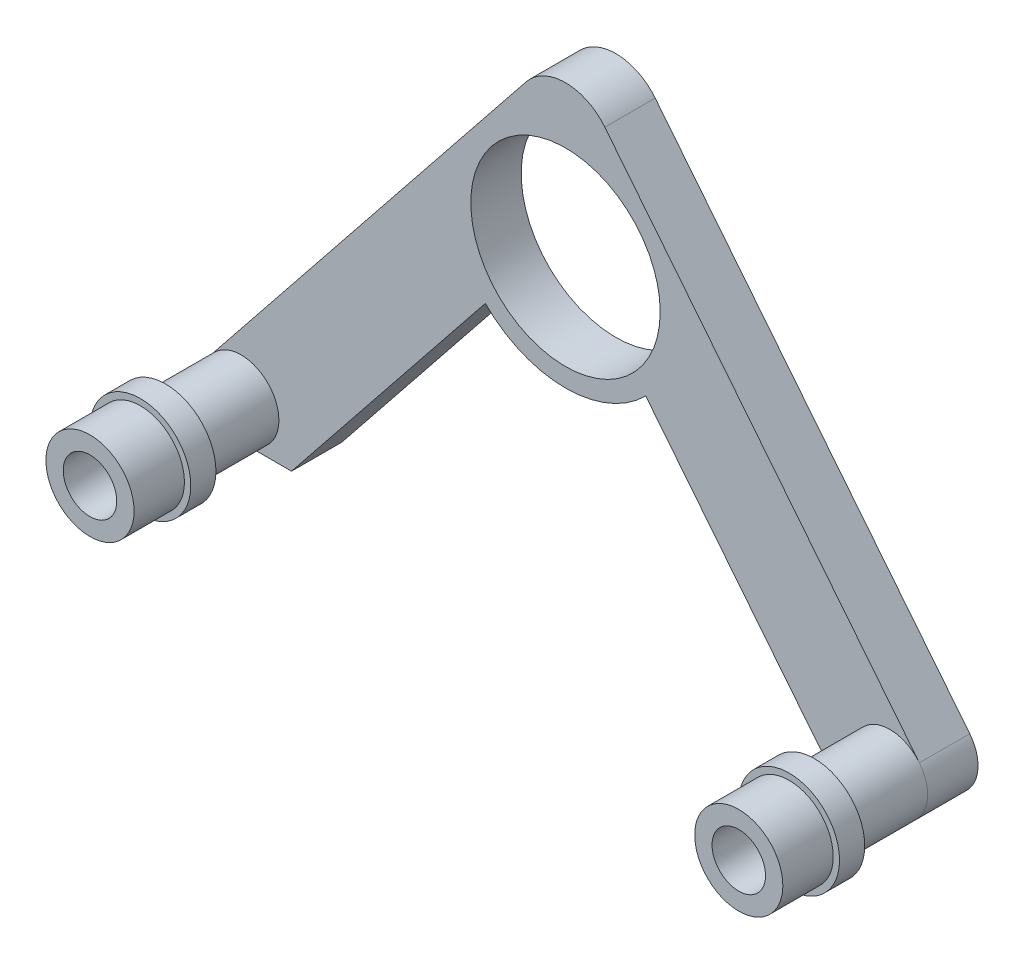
ISO-10303-21;
HEADER;
FILE_DESCRIPTION(('STEP AP214'),'2;1');
FILE_NAME('part.step','',(''),(''),'','','');
FILE_SCHEMA(('AUTOMOTIVE_DESIGN { 1 0 10303 214 1 1 1 1 }'));
ENDSEC;
DATA;
#1=APPLICATION_CONTEXT('core data for automotive mechanical design processes');
#2=APPLICATION_PROTOCOL_DEFINITION('international standard','automotive_design',2000,#1);
#3=PRODUCT_CONTEXT('',#1,'mechanical');
#4=PRODUCT('Part','Part','',(#3));
#5=PRODUCT_RELATED_PRODUCT_CATEGORY('part','',(#4));
#6=PRODUCT_DEFINITION_FORMATION('','',#4);
#7=PRODUCT_DEFINITION_CONTEXT('part definition',#1,'design');
#8=PRODUCT_DEFINITION('design','',#6,#7);
#9=PRODUCT_DEFINITION_SHAPE('','',#8);
#10=(LENGTH_UNIT() NAMED_UNIT(*) SI_UNIT(.MILLI.,.METRE.));
#11=(NAMED_UNIT(*) PLANE_ANGLE_UNIT() SI_UNIT($,.RADIAN.));
#12=(NAMED_UNIT(*) SI_UNIT($,.STERADIAN.) SOLID_ANGLE_UNIT());
#13=UNCERTAINTY_MEASURE_WITH_UNIT(LENGTH_MEASURE(1.E-05),#10,'distance_accuracy_value','');
#14=(GEOMETRIC_REPRESENTATION_CONTEXT(3) GLOBAL_UNCERTAINTY_ASSIGNED_CONTEXT((#13)) GLOBAL_UNIT_ASSIGNED_CONTEXT((#10,
#11,#12)) REPRESENTATION_CONTEXT('',''));
#15=CARTESIAN_POINT('',(0.,0.,0.));
#16=DIRECTION('',(0.,0.,1.));
#17=DIRECTION('',(1.,0.,0.));
#18=AXIS2_PLACEMENT_3D('',#15,#16,#17);
#19=CARTESIAN_POINT('',(-81.7820483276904,9.52500000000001,31.75));
#20=DIRECTION('',(0.,0.,1.));
#21=DIRECTION('',(1.,0.,0.));
#22=AXIS2_PLACEMENT_3D('',#19,#20,#21);
#23=CYLINDRICAL_SURFACE('',#22,12.7);
#24=CARTESIAN_POINT('',(-81.7820483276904,9.52500000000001,31.75));
#25=DIRECTION('',(0.,0.,1.));
#26=DIRECTION('',(1.,0.,0.));
#27=AXIS2_PLACEMENT_3D('',#24,#25,#26);
#28=CIRCLE('',#27,12.7);
#29=CARTESIAN_POINT('',(-69.0820483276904,9.52500000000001,31.75));
#30=VERTEX_POINT('',#29);
#31=EDGE_CURVE('E263',#30,#30,#28,.T.);
#32=CARTESIAN_POINT('',(-81.7820483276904,9.52500000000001,38.1));
#33=DIRECTION('',(0.,0.,1.));
#34=DIRECTION('',(1.,0.,0.));
#35=AXIS2_PLACEMENT_3D('',#32,#33,#34);
#36=CIRCLE('',#35,12.7);
#37=CARTESIAN_POINT('',(-69.0820483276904,9.52500000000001,38.1));
#38=VERTEX_POINT('',#37);
#39=EDGE_CURVE('E264',#38,#38,#36,.T.);
#40=CARTESIAN_POINT('',(-69.0820483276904,9.52500000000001,31.75));
#41=CARTESIAN_POINT('',(-69.0820483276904,9.52500000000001,31.8161458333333));
#42=CARTESIAN_POINT('',(-69.0820483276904,9.52500000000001,31.8822916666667));
#43=CARTESIAN_POINT('',(-69.0820483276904,9.52500000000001,32.0145833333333));
#44=CARTESIAN_POINT('',(-69.0820483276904,9.52500000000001,32.0807291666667));
#45=CARTESIAN_POINT('',(-69.0820483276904,9.52500000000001,32.2130208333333));
#46=CARTESIAN_POINT('',(-69.0820483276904,9.52500000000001,32.2791666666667));
#47=CARTESIAN_POINT('',(-69.0820483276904,9.52500000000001,32.4114583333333));
#48=CARTESIAN_POINT('',(-69.0820483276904,9.52500000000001,32.4776041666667));
#49=CARTESIAN_POINT('',(-69.0820483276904,9.52500000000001,32.6098958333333));
#50=CARTESIAN_POINT('',(-69.0820483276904,9.52500000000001,32.6760416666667));
#51=CARTESIAN_POINT('',(-69.0820483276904,9.52500000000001,32.8083333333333));
#52=CARTESIAN_POINT('',(-69.0820483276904,9.52500000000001,32.8744791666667));
#53=CARTESIAN_POINT('',(-69.0820483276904,9.52500000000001,33.0067708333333));
#54=CARTESIAN_POINT('',(-69.0820483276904,9.52500000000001,33.0729166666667));
#55=CARTESIAN_POINT('',(-69.0820483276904,9.52500000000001,33.2052083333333));
#56=CARTESIAN_POINT('',(-69.0820483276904,9.52500000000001,33.2713541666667));
#57=CARTESIAN_POINT('',(-69.0820483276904,9.52500000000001,33.4036458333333));
#58=CARTESIAN_POINT('',(-69.0820483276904,9.52500000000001,33.4697916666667));
#59=CARTESIAN_POINT('',(-69.0820483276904,9.52500000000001,33.6020833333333));
#60=CARTESIAN_POINT('',(-69.0820483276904,9.52500000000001,33.6682291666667));
#61=CARTESIAN_POINT('',(-69.0820483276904,9.52500000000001,33.8005208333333));
#62=CARTESIAN_POINT('',(-69.0820483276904,9.52500000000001,33.8666666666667));
#63=CARTESIAN_POINT('',(-69.0820483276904,9.52500000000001,33.9989583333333));
#64=CARTESIAN_POINT('',(-69.0820483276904,9.52500000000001,34.0651041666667));
#65=CARTESIAN_POINT('',(-69.0820483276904,9.52500000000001,34.1973958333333));
#66=CARTESIAN_POINT('',(-69.0820483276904,9.52500000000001,34.2635416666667));
#67=CARTESIAN_POINT('',(-69.0820483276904,9.52500000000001,34.3958333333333));
#68=CARTESIAN_POINT('',(-69.0820483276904,9.52500000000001,34.4619791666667));
#69=CARTESIAN_POINT('',(-69.0820483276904,9.52500000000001,34.5942708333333));
#70=CARTESIAN_POINT('',(-69.0820483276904,9.52500000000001,34.6604166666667));
#71=CARTESIAN_POINT('',(-69.0820483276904,9.52500000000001,34.7927083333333));
#72=CARTESIAN_POINT('',(-69.0820483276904,9.52500000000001,34.8588541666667));
#73=CARTESIAN_POINT('',(-69.0820483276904,9.52500000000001,34.9911458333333));
#74=CARTESIAN_POINT('',(-69.0820483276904,9.52500000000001,35.0572916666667));
#75=CARTESIAN_POINT('',(-69.0820483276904,9.52500000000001,35.1895833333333));
#76=CARTESIAN_POINT('',(-69.0820483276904,9.52500000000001,35.2557291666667));
#77=CARTESIAN_POINT('',(-69.0820483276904,9.52500000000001,35.3880208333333));
#78=CARTESIAN_POINT('',(-69.0820483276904,9.52500000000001,35.4541666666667));
#79=CARTESIAN_POINT('',(-69.0820483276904,9.52500000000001,35.5864583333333));
#80=CARTESIAN_POINT('',(-69.0820483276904,9.52500000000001,35.6526041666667));
#81=CARTESIAN_POINT('',(-69.0820483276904,9.52500000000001,35.7848958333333));
#82=CARTESIAN_POINT('',(-69.0820483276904,9.52500000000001,35.8510416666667));
#83=CARTESIAN_POINT('',(-69.0820483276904,9.52500000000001,35.9833333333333));
#84=CARTESIAN_POINT('',(-69.0820483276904,9.52500000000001,36.0494791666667));
#85=CARTESIAN_POINT('',(-69.0820483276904,9.52500000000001,36.1817708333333));
#86=CARTESIAN_POINT('',(-69.0820483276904,9.52500000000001,36.2479166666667));
#87=CARTESIAN_POINT('',(-69.0820483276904,9.52500000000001,36.3802083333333));
#88=CARTESIAN_POINT('',(-69.0820483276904,9.52500000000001,36.4463541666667));
#89=CARTESIAN_POINT('',(-69.0820483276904,9.52500000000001,36.5786458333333));
#90=CARTESIAN_POINT('',(-69.0820483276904,9.52500000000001,36.6447916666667));
#91=CARTESIAN_POINT('',(-69.0820483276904,9.52500000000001,36.7770833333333));
#92=CARTESIAN_POINT('',(-69.0820483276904,9.52500000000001,36.8432291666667));
#93=CARTESIAN_POINT('',(-69.0820483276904,9.52500000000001,36.9755208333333));
#94=CARTESIAN_POINT('',(-69.0820483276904,9.52500000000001,37.0416666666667));
#95=CARTESIAN_POINT('',(-69.0820483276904,9.52500000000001,37.1739583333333));
#96=CARTESIAN_POINT('',(-69.0820483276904,9.52500000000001,37.2401041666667));
#97=CARTESIAN_POINT('',(-69.0820483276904,9.52500000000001,37.3723958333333));
#98=CARTESIAN_POINT('',(-69.0820483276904,9.52500000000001,37.4385416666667));
#99=CARTESIAN_POINT('',(-69.0820483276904,9.52500000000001,37.5708333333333));
#100=CARTESIAN_POINT('',(-69.0820483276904,9.52500000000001,37.6369791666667));
#101=CARTESIAN_POINT('',(-69.0820483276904,9.52500000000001,37.7692708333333));
#102=CARTESIAN_POINT('',(-69.0820483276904,9.52500000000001,37.8354166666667));
#103=CARTESIAN_POINT('',(-69.0820483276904,9.52500000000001,37.9677083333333));
#104=CARTESIAN_POINT('',(-69.0820483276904,9.52500000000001,38.0338541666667));
#105=CARTESIAN_POINT('',(-69.0820483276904,9.52500000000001,38.1));
#106=B_SPLINE_CURVE_WITH_KNOTS('',3,(#40,#41,#42,#43,#44,#45,#46,#47,#48,#49,#50,#51,#52,#53,
#54,#55,#56,#57,#58,#59,#60,#61,#62,#63,#64,#65,#66,#67,#68,#69,#70,#71,#72,#73,#74,#75,#76,#77,
#78,#79,#80,#81,#82,#83,#84,#85,#86,#87,#88,#89,#90,#91,#92,#93,#94,#95,#96,#97,#98,#99,#100,
#101,#102,#103,#104,#105),.UNSPECIFIED.,.F.,.F.,(4,2,2,2,2,2,2,2,2,2,2,2,2,2,2,2,2,2,2,2,2,2,2,
2,2,2,2,2,2,2,2,2,4),(0.,0.198437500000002,0.396875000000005,0.5953125,0.793750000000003,
0.992187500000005,1.190625,1.3890625,1.5875,1.7859375,1.984375,2.1828125,2.38125,2.5796875,
2.778125,2.9765625,3.175,3.3734375,3.571875,3.7703125,3.96875,4.1671875,4.365625,4.5640625,
4.7625,4.9609375,5.159375,5.3578125,5.55625,5.7546875,5.953125,6.1515625,6.34999999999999),.UNSPECIFIED.);
#107=EDGE_CURVE('BSEAM35',#30,#38,#106,.T.);
#108=ORIENTED_EDGE('',*,*,#31,.T.);
#109=ORIENTED_EDGE('',*,*,#39,.F.);
#110=ORIENTED_EDGE('',*,*,#107,.T.);
#111=ORIENTED_EDGE('',*,*,#107,.F.);
#112=EDGE_LOOP('',(#108,#110,#109,#111));
#113=FACE_BOUND('',#112,.T.);
#114=ADVANCED_FACE('F35',(#113),#23,.T.);
#115=CARTESIAN_POINT('',(81.7820483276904,9.525,31.75));
#116=DIRECTION('',(0.,0.,1.));
#117=DIRECTION('',(1.,0.,0.));
#118=AXIS2_PLACEMENT_3D('',#115,#116,#117);
#119=CYLINDRICAL_SURFACE('',#118,12.7);
#120=CARTESIAN_POINT('',(81.7820483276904,9.525,31.75));
#121=DIRECTION('',(0.,0.,1.));
#122=DIRECTION('',(1.,0.,0.));
#123=AXIS2_PLACEMENT_3D('',#120,#121,#122);
#124=CIRCLE('',#123,12.7);
#125=CARTESIAN_POINT('',(94.4820483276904,9.525,31.75));
#126=VERTEX_POINT('',#125);
#127=EDGE_CURVE('E260',#126,#126,#124,.T.);
#128=CARTESIAN_POINT('',(81.7820483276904,9.525,38.1));
#129=DIRECTION('',(0.,0.,1.));
#130=DIRECTION('',(1.,0.,0.));
#131=AXIS2_PLACEMENT_3D('',#128,#129,#130);
#132=CIRCLE('',#131,12.7);
#133=CARTESIAN_POINT('',(94.4820483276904,9.525,38.1));
#134=VERTEX_POINT('',#133);
#135=EDGE_CURVE('E250',#134,#134,#132,.T.);
#136=CARTESIAN_POINT('',(94.4820483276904,9.525,31.75));
#137=CARTESIAN_POINT('',(94.4820483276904,9.525,31.8161458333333));
#138=CARTESIAN_POINT('',(94.4820483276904,9.525,31.8822916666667));
#139=CARTESIAN_POINT('',(94.4820483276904,9.525,32.0145833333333));
#140=CARTESIAN_POINT('',(94.4820483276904,9.525,32.0807291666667));
#141=CARTESIAN_POINT('',(94.4820483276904,9.525,32.2130208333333));
#142=CARTESIAN_POINT('',(94.4820483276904,9.525,32.2791666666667));
#143=CARTESIAN_POINT('',(94.4820483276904,9.525,32.4114583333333));
#144=CARTESIAN_POINT('',(94.4820483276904,9.525,32.4776041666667));
#145=CARTESIAN_POINT('',(94.4820483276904,9.525,32.6098958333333));
#146=CARTESIAN_POINT('',(94.4820483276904,9.525,32.6760416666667));
#147=CARTESIAN_POINT('',(94.4820483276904,9.525,32.8083333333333));
#148=CARTESIAN_POINT('',(94.4820483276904,9.525,32.8744791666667));
#149=CARTESIAN_POINT('',(94.4820483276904,9.525,33.0067708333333));
#150=CARTESIAN_POINT('',(94.4820483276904,9.525,33.0729166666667));
#151=CARTESIAN_POINT('',(94.4820483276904,9.525,33.2052083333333));
#152=CARTESIAN_POINT('',(94.4820483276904,9.525,33.2713541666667));
#153=CARTESIAN_POINT('',(94.4820483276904,9.525,33.4036458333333));
#154=CARTESIAN_POINT('',(94.4820483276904,9.525,33.4697916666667));
#155=CARTESIAN_POINT('',(94.4820483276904,9.525,33.6020833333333));
#156=CARTESIAN_POINT('',(94.4820483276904,9.525,33.6682291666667));
#157=CARTESIAN_POINT('',(94.4820483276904,9.525,33.8005208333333));
#158=CARTESIAN_POINT('',(94.4820483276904,9.525,33.8666666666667));
#159=CARTESIAN_POINT('',(94.4820483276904,9.525,33.9989583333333));
#160=CARTESIAN_POINT('',(94.4820483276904,9.525,34.0651041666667));
#161=CARTESIAN_POINT('',(94.4820483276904,9.525,34.1973958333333));
#162=CARTESIAN_POINT('',(94.4820483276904,9.525,34.2635416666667));
#163=CARTESIAN_POINT('',(94.4820483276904,9.525,34.3958333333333));
#164=CARTESIAN_POINT('',(94.4820483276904,9.525,34.4619791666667));
#165=CARTESIAN_POINT('',(94.4820483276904,9.525,34.5942708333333));
#166=CARTESIAN_POINT('',(94.4820483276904,9.525,34.6604166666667));
#167=CARTESIAN_POINT('',(94.4820483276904,9.525,34.7927083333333));
#168=CARTESIAN_POINT('',(94.4820483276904,9.525,34.8588541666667));
#169=CARTESIAN_POINT('',(94.4820483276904,9.525,34.9911458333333));
#170=CARTESIAN_POINT('',(94.4820483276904,9.525,35.0572916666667));
#171=CARTESIAN_POINT('',(94.4820483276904,9.525,35.1895833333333));
#172=CARTESIAN_POINT('',(94.4820483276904,9.525,35.2557291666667));
#173=CARTESIAN_POINT('',(94.4820483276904,9.525,35.3880208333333));
#174=CARTESIAN_POINT('',(94.4820483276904,9.525,35.4541666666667));
#175=CARTESIAN_POINT('',(94.4820483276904,9.525,35.5864583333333));
#176=CARTESIAN_POINT('',(94.4820483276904,9.525,35.6526041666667));
#177=CARTESIAN_POINT('',(94.4820483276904,9.525,35.7848958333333));
#178=CARTESIAN_POINT('',(94.4820483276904,9.525,35.8510416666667));
#179=CARTESIAN_POINT('',(94.4820483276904,9.525,35.9833333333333));
#180=CARTESIAN_POINT('',(94.4820483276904,9.525,36.0494791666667));
#181=CARTESIAN_POINT('',(94.4820483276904,9.525,36.1817708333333));
#182=CARTESIAN_POINT('',(94.4820483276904,9.525,36.2479166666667));
#183=CARTESIAN_POINT('',(94.4820483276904,9.525,36.3802083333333));
#184=CARTESIAN_POINT('',(94.4820483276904,9.525,36.4463541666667));
#185=CARTESIAN_POINT('',(94.4820483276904,9.525,36.5786458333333));
#186=CARTESIAN_POINT('',(94.4820483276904,9.525,36.6447916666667));
#187=CARTESIAN_POINT('',(94.4820483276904,9.525,36.7770833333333));
#188=CARTESIAN_POINT('',(94.4820483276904,9.525,36.8432291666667));
#189=CARTESIAN_POINT('',(94.4820483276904,9.525,36.9755208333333));
#190=CARTESIAN_POINT('',(94.4820483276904,9.525,37.0416666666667));
#191=CARTESIAN_POINT('',(94.4820483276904,9.525,37.1739583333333));
#192=CARTESIAN_POINT('',(94.4820483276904,9.525,37.2401041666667));
#193=CARTESIAN_POINT('',(94.4820483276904,9.525,37.3723958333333));
#194=CARTESIAN_POINT('',(94.4820483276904,9.525,37.4385416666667));
#195=CARTESIAN_POINT('',(94.4820483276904,9.525,37.5708333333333));
#196=CARTESIAN_POINT('',(94.4820483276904,9.525,37.6369791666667));
#197=CARTESIAN_POINT('',(94.4820483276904,9.525,37.7692708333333));
#198=CARTESIAN_POINT('',(94.4820483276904,9.525,37.8354166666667));
#199=CARTESIAN_POINT('',(94.4820483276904,9.525,37.9677083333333));
#200=CARTESIAN_POINT('',(94.4820483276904,9.525,38.0338541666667));
#201=CARTESIAN_POINT('',(94.4820483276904,9.525,38.1));
#202=B_SPLINE_CURVE_WITH_KNOTS('',3,(#136,#137,#138,#139,#140,#141,#142,#143,#144,#145,#146,
#147,#148,#149,#150,#151,#152,#153,#154,#155,#156,#157,#158,#159,#160,#161,#162,#163,#164,#165,
#166,#167,#168,#169,#170,#171,#172,#173,#174,#175,#176,#177,#178,#179,#180,#181,#182,#183,#184,
#185,#186,#187,#188,#189,#190,#191,#192,#193,#194,#195,#196,#197,#198,#199,#200,#201),
.UNSPECIFIED.,.F.,.F.,(4,2,2,2,2,2,2,2,2,2,2,2,2,2,2,2,2,2,2,2,2,2,2,2,2,2,2,2,2,2,2,2,4),(0.,
0.198437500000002,0.396875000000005,0.5953125,0.793750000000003,0.992187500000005,1.190625,
1.3890625,1.5875,1.7859375,1.984375,2.1828125,2.38125,2.5796875,2.778125,2.9765625,3.175,
3.3734375,3.571875,3.7703125,3.96875,4.1671875,4.365625,4.5640625,4.7625,4.9609375,5.159375,
5.3578125,5.55625,5.7546875,5.953125,6.1515625,6.34999999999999),.UNSPECIFIED.);
#203=EDGE_CURVE('BSEAM201',#126,#134,#202,.T.);
#204=ORIENTED_EDGE('',*,*,#127,.T.);
#205=ORIENTED_EDGE('',*,*,#135,.F.);
#206=ORIENTED_EDGE('',*,*,#203,.T.);
#207=ORIENTED_EDGE('',*,*,#203,.F.);
#208=EDGE_LOOP('',(#204,#206,#205,#207));
#209=FACE_BOUND('',#208,.T.);
#210=ADVANCED_FACE('F201',(#209),#119,.T.);
#211=CARTESIAN_POINT('',(81.7820483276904,9.525,50.8));
#212=DIRECTION('',(0.,0.,-1.));
#213=DIRECTION('',(-1.,0.,0.));
#214=AXIS2_PLACEMENT_3D('',#211,#212,#213);
#215=CYLINDRICAL_SURFACE('',#214,9.52500000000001);
#216=CARTESIAN_POINT('',(81.7820483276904,9.525,12.7));
#217=DIRECTION('',(0.,0.,1.));
#218=DIRECTION('',(1.,0.,0.));
#219=AXIS2_PLACEMENT_3D('',#216,#217,#218);
#220=CIRCLE('',#219,9.52500000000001);
#221=CARTESIAN_POINT('',(89.2198237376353,15.4752203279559,12.7));
#222=VERTEX_POINT('',#221);
#223=CARTESIAN_POINT('',(81.7820483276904,0.,12.7));
#224=VERTEX_POINT('',#223);
#225=EDGE_CURVE('E266',#222,#224,#220,.T.);
#226=ORIENTED_EDGE('',*,*,#225,.T.);
#227=CARTESIAN_POINT('',(81.7820483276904,9.525,12.7));
#228=DIRECTION('',(0.,0.,1.));
#229=DIRECTION('',(1.,0.,0.));
#230=AXIS2_PLACEMENT_3D('',#227,#228,#229);
#231=CIRCLE('',#230,9.52500000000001);
#232=EDGE_CURVE('E163',#222,#224,#231,.F.);
#233=ORIENTED_EDGE('',*,*,#232,.F.);
#234=EDGE_LOOP('',(#226,#233));
#235=FACE_BOUND('',#234,.T.);
#236=CARTESIAN_POINT('',(81.7820483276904,9.525,31.75));
#237=DIRECTION('',(0.,0.,1.));
#238=DIRECTION('',(1.,0.,0.));
#239=AXIS2_PLACEMENT_3D('',#236,#237,#238);
#240=CIRCLE('',#239,9.52500000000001);
#241=CARTESIAN_POINT('',(91.3070483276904,9.525,31.75));
#242=VERTEX_POINT('',#241);
#243=EDGE_CURVE('E43',#242,#242,#240,.T.);
#244=ORIENTED_EDGE('',*,*,#243,.F.);
#245=EDGE_LOOP('',(#244));
#246=FACE_BOUND('',#245,.T.);
#247=ADVANCED_FACE('F198',(#235,#246),#215,.T.);
#248=CARTESIAN_POINT('',(-81.7820483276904,9.52500000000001,50.8));
#249=DIRECTION('',(0.,0.,-1.));
#250=DIRECTION('',(-1.,0.,0.));
#251=AXIS2_PLACEMENT_3D('',#248,#249,#250);
#252=CYLINDRICAL_SURFACE('',#251,9.52500000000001);
#253=CARTESIAN_POINT('',(-81.7820483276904,9.52500000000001,12.7));
#254=DIRECTION('',(0.,0.,1.));
#255=DIRECTION('',(1.,0.,0.));
#256=AXIS2_PLACEMENT_3D('',#253,#254,#255);
#257=CIRCLE('',#256,9.52500000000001);
#258=CARTESIAN_POINT('',(-89.2198237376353,15.4752203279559,12.7));
#259=VERTEX_POINT('',#258);
#260=CARTESIAN_POINT('',(-81.7820483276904,0.,12.7));
#261=VERTEX_POINT('',#260);
#262=EDGE_CURVE('E145',#259,#261,#257,.T.);
#263=ORIENTED_EDGE('',*,*,#262,.T.);
#264=EDGE_CURVE('E158',#261,#259,#257,.T.);
#265=ORIENTED_EDGE('',*,*,#264,.T.);
#266=EDGE_LOOP('',(#263,#265));
#267=FACE_BOUND('',#266,.T.);
#268=CARTESIAN_POINT('',(-81.7820483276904,9.52500000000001,31.75));
#269=DIRECTION('',(0.,0.,1.));
#270=DIRECTION('',(1.,0.,0.));
#271=AXIS2_PLACEMENT_3D('',#268,#269,#270);
#272=CIRCLE('',#271,9.52500000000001);
#273=CARTESIAN_POINT('',(-72.2570483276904,9.52500000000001,31.75));
#274=VERTEX_POINT('',#273);
#275=EDGE_CURVE('E190',#274,#274,#272,.T.);
#276=ORIENTED_EDGE('',*,*,#275,.F.);
#277=EDGE_LOOP('',(#276));
#278=FACE_BOUND('',#277,.T.);
#279=ADVANCED_FACE('F200',(#267,#278),#252,.T.);
#280=CARTESIAN_POINT('',(0.,0.,12.7));
#281=DIRECTION('',(0.,0.,1.));
#282=DIRECTION('',(1.,0.,0.));
#283=AXIS2_PLACEMENT_3D('',#280,#281,#282);
#284=PLANE('',#283);
#285=CARTESIAN_POINT('',(0.,81.2576812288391,12.7));
#286=DIRECTION('',(0.,0.,1.));
#287=DIRECTION('',(1.,0.,0.));
#288=AXIS2_PLACEMENT_3D('',#285,#286,#287);
#289=CIRCLE('',#288,23.876);
#290=CARTESIAN_POINT('',(23.876,81.2576812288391,12.7));
#291=VERTEX_POINT('',#290);
#292=EDGE_CURVE('E540',#291,#291,#289,.T.);
#293=ORIENTED_EDGE('',*,*,#292,.F.);
#294=EDGE_LOOP('',(#293));
#295=FACE_BOUND('',#294,.T.);
#296=DIRECTION('',(-0.624695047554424,0.78086880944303,0.));
#297=VECTOR('',#296,1.);
#298=CARTESIAN_POINT('',(0.,127.,12.7));
#299=LINE('',#298,#297);
#300=CARTESIAN_POINT('',(9.91703387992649,114.603707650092,12.7));
#301=VERTEX_POINT('',#300);
#302=EDGE_CURVE('E149',#222,#301,#299,.T.);
#303=ORIENTED_EDGE('',*,*,#302,.T.);
#304=CARTESIAN_POINT('',(0.,106.670080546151,12.7));
#305=DIRECTION('',(0.,0.,1.));
#306=DIRECTION('',(1.,0.,0.));
#307=AXIS2_PLACEMENT_3D('',#304,#305,#306);
#308=CIRCLE('',#307,12.7);
#309=CARTESIAN_POINT('',(-9.91703387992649,114.603707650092,12.7));
#310=VERTEX_POINT('',#309);
#311=EDGE_CURVE('E174',#301,#310,#308,.T.);
#312=ORIENTED_EDGE('',*,*,#311,.T.);
#313=DIRECTION('',(-0.624695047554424,-0.78086880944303,0.));
#314=VECTOR('',#313,1.);
#315=CARTESIAN_POINT('',(-101.6,0.,12.7));
#316=LINE('',#315,#314);
#317=EDGE_CURVE('E151',#310,#259,#316,.T.);
#318=ORIENTED_EDGE('',*,*,#317,.T.);
#319=ORIENTED_EDGE('',*,*,#264,.F.);
#320=DIRECTION('',(1.,0.,0.));
#321=VECTOR('',#320,1.);
#322=CARTESIAN_POINT('',(-101.6,0.,12.7));
#323=LINE('',#322,#321);
#324=CARTESIAN_POINT('',(-69.0721288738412,0.,12.7));
#325=VERTEX_POINT('',#324);
#326=EDGE_CURVE('E155',#261,#325,#323,.T.);
#327=ORIENTED_EDGE('',*,*,#326,.T.);
#328=DIRECTION('',(-0.624695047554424,-0.78086880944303,0.));
#329=VECTOR('',#328,1.);
#330=CARTESIAN_POINT('',(-69.0721288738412,0.,12.7));
#331=LINE('',#330,#329);
#332=CARTESIAN_POINT('',(-20.2193879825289,61.0659261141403,12.7));
#333=VERTEX_POINT('',#332);
#334=EDGE_CURVE('E138',#333,#325,#331,.T.);
#335=ORIENTED_EDGE('',*,*,#334,.F.);
#336=CARTESIAN_POINT('',(0.,81.2576812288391,12.7));
#337=DIRECTION('',(0.,0.,1.));
#338=DIRECTION('',(1.,0.,0.));
#339=AXIS2_PLACEMENT_3D('',#336,#337,#338);
#340=CIRCLE('',#339,28.575);
#341=CARTESIAN_POINT('',(20.2193879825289,61.0659261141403,12.7));
#342=VERTEX_POINT('',#341);
#343=EDGE_CURVE('E114',#342,#333,#340,.F.);
#344=ORIENTED_EDGE('',*,*,#343,.F.);
#345=DIRECTION('',(-0.624695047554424,0.78086880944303,0.));
#346=VECTOR('',#345,1.);
#347=CARTESIAN_POINT('',(0.,86.3401610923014,12.7));
#348=LINE('',#347,#346);
#349=CARTESIAN_POINT('',(69.0721288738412,0.,12.7));
#350=VERTEX_POINT('',#349);
#351=EDGE_CURVE('E142',#350,#342,#348,.T.);
#352=ORIENTED_EDGE('',*,*,#351,.F.);
#353=EDGE_CURVE('E154',#350,#224,#323,.T.);
#354=ORIENTED_EDGE('',*,*,#353,.T.);
#355=ORIENTED_EDGE('',*,*,#225,.F.);
#356=EDGE_LOOP('',(#303,#312,#318,#319,#327,#335,#344,#352,#354,#355));
#357=FACE_BOUND('',#356,.T.);
#358=ADVANCED_FACE('F208',(#295,#357),#284,.T.);
#359=CARTESIAN_POINT('',(-101.6,0.,12.7));
#360=DIRECTION('',(0.,1.,0.));
#361=DIRECTION('',(-1.,0.,0.));
#362=AXIS2_PLACEMENT_3D('',#359,#360,#361);
#363=PLANE('',#362);
#364=ORIENTED_EDGE('',*,*,#326,.F.);
#365=DIRECTION('',(0.,0.,-1.));
#366=VECTOR('',#365,1.);
#367=CARTESIAN_POINT('',(-81.7820483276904,0.,12.7));
#368=LINE('',#367,#366);
#369=CARTESIAN_POINT('',(-81.7820483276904,0.,0.));
#370=VERTEX_POINT('',#369);
#371=EDGE_CURVE('E183',#261,#370,#368,.T.);
#372=ORIENTED_EDGE('',*,*,#371,.T.);
#373=DIRECTION('',(1.,0.,0.));
#374=VECTOR('',#373,1.);
#375=CARTESIAN_POINT('',(-101.6,0.,0.));
#376=LINE('',#375,#374);
#377=CARTESIAN_POINT('',(-69.0721288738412,0.,0.));
#378=VERTEX_POINT('',#377);
#379=EDGE_CURVE('E152',#370,#378,#376,.T.);
#380=ORIENTED_EDGE('',*,*,#379,.T.);
#381=DIRECTION('',(0.,0.,1.));
#382=VECTOR('',#381,1.);
#383=CARTESIAN_POINT('',(-69.0721288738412,0.,0.));
#384=LINE('',#383,#382);
#385=EDGE_CURVE('E134',#378,#325,#384,.T.);
#386=ORIENTED_EDGE('',*,*,#385,.T.);
#387=EDGE_LOOP('',(#364,#372,#380,#386));
#388=FACE_BOUND('',#387,.T.);
#389=ADVANCED_FACE('F277',(#388),#363,.F.);
#390=CARTESIAN_POINT('',(0.,127.,12.7));
#391=DIRECTION('',(-0.78086880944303,-0.624695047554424,0.));
#392=DIRECTION('',(0.624695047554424,-0.78086880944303,0.));
#393=AXIS2_PLACEMENT_3D('',#390,#391,#392);
#394=PLANE('',#393);
#395=DIRECTION('',(0.,0.,-1.));
#396=VECTOR('',#395,1.);
#397=CARTESIAN_POINT('',(9.91703387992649,114.603707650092,12.7));
#398=LINE('',#397,#396);
#399=CARTESIAN_POINT('',(9.91703387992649,114.603707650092,0.));
#400=VERTEX_POINT('',#399);
#401=EDGE_CURVE('E171',#400,#301,#398,.F.);
#402=ORIENTED_EDGE('',*,*,#401,.T.);
#403=ORIENTED_EDGE('',*,*,#302,.F.);
#404=DIRECTION('',(0.,0.,-1.));
#405=VECTOR('',#404,1.);
#406=CARTESIAN_POINT('',(89.2198237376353,15.4752203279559,12.7));
#407=LINE('',#406,#405);
#408=CARTESIAN_POINT('',(89.2198237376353,15.4752203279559,0.));
#409=VERTEX_POINT('',#408);
#410=EDGE_CURVE('E176',#222,#409,#407,.T.);
#411=ORIENTED_EDGE('',*,*,#410,.T.);
#412=DIRECTION('',(-0.624695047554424,0.78086880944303,0.));
#413=VECTOR('',#412,1.);
#414=CARTESIAN_POINT('',(0.,127.,0.));
#415=LINE('',#414,#413);
#416=EDGE_CURVE('E147',#409,#400,#415,.T.);
#417=ORIENTED_EDGE('',*,*,#416,.T.);
#418=EDGE_LOOP('',(#402,#403,#411,#417));
#419=FACE_BOUND('',#418,.T.);
#420=ADVANCED_FACE('F286',(#419),#394,.F.);
#421=CARTESIAN_POINT('',(-101.6,0.,12.7));
#422=DIRECTION('',(0.78086880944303,-0.624695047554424,0.));
#423=DIRECTION('',(0.624695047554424,0.78086880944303,0.));
#424=AXIS2_PLACEMENT_3D('',#421,#422,#423);
#425=PLANE('',#424);
#426=DIRECTION('',(0.,0.,-1.));
#427=VECTOR('',#426,1.);
#428=CARTESIAN_POINT('',(-89.2198237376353,15.4752203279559,12.7));
#429=LINE('',#428,#427);
#430=CARTESIAN_POINT('',(-89.2198237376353,15.4752203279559,0.));
#431=VERTEX_POINT('',#430);
#432=EDGE_CURVE('E188',#431,#259,#429,.F.);
#433=ORIENTED_EDGE('',*,*,#432,.T.);
#434=ORIENTED_EDGE('',*,*,#317,.F.);
#435=DIRECTION('',(0.,0.,-1.));
#436=VECTOR('',#435,1.);
#437=CARTESIAN_POINT('',(-9.91703387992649,114.603707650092,12.7));
#438=LINE('',#437,#436);
#439=CARTESIAN_POINT('',(-9.91703387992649,114.603707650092,0.));
#440=VERTEX_POINT('',#439);
#441=EDGE_CURVE('E166',#310,#440,#438,.T.);
#442=ORIENTED_EDGE('',*,*,#441,.T.);
#443=DIRECTION('',(-0.624695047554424,-0.78086880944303,0.));
#444=VECTOR('',#443,1.);
#445=CARTESIAN_POINT('',(-101.6,0.,0.));
#446=LINE('',#445,#444);
#447=EDGE_CURVE('E57',#440,#431,#446,.T.);
#448=ORIENTED_EDGE('',*,*,#447,.T.);
#449=EDGE_LOOP('',(#433,#434,#442,#448));
#450=FACE_BOUND('',#449,.T.);
#451=ADVANCED_FACE('F354',(#450),#425,.F.);
#452=CARTESIAN_POINT('',(69.0721288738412,0.,0.));
#453=VERTEX_POINT('',#452);
#454=CARTESIAN_POINT('',(81.7820483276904,0.,0.));
#455=VERTEX_POINT('',#454);
#456=EDGE_CURVE('E161',#453,#455,#376,.T.);
#457=ORIENTED_EDGE('',*,*,#456,.T.);
#458=DIRECTION('',(0.,0.,-1.));
#459=VECTOR('',#458,1.);
#460=CARTESIAN_POINT('',(81.7820483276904,0.,12.7));
#461=LINE('',#460,#459);
#462=EDGE_CURVE('E181',#455,#224,#461,.F.);
#463=ORIENTED_EDGE('',*,*,#462,.T.);
#464=ORIENTED_EDGE('',*,*,#353,.F.);
#465=DIRECTION('',(0.,0.,1.));
#466=VECTOR('',#465,1.);
#467=CARTESIAN_POINT('',(69.0721288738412,0.,0.));
#468=LINE('',#467,#466);
#469=EDGE_CURVE('E135',#453,#350,#468,.T.);
#470=ORIENTED_EDGE('',*,*,#469,.F.);
#471=EDGE_LOOP('',(#457,#463,#464,#470));
#472=FACE_BOUND('',#471,.T.);
#473=ADVANCED_FACE('F294',(#472),#363,.F.);
#474=CARTESIAN_POINT('',(0.,0.,0.));
#475=DIRECTION('',(0.,0.,1.));
#476=DIRECTION('',(1.,0.,0.));
#477=AXIS2_PLACEMENT_3D('',#474,#475,#476);
#478=PLANE('',#477);
#479=CARTESIAN_POINT('',(0.,81.2576812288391,0.));
#480=DIRECTION('',(0.,0.,1.));
#481=DIRECTION('',(1.,0.,0.));
#482=AXIS2_PLACEMENT_3D('',#479,#480,#481);
#483=CIRCLE('',#482,23.876);
#484=CARTESIAN_POINT('',(23.876,81.2576812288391,0.));
#485=VERTEX_POINT('',#484);
#486=EDGE_CURVE('E129',#485,#485,#483,.F.);
#487=ORIENTED_EDGE('',*,*,#486,.F.);
#488=EDGE_LOOP('',(#487));
#489=FACE_BOUND('',#488,.T.);
#490=CARTESIAN_POINT('',(81.7820483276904,9.525,0.));
#491=DIRECTION('',(0.,0.,1.));
#492=DIRECTION('',(1.,0.,0.));
#493=AXIS2_PLACEMENT_3D('',#490,#491,#492);
#494=CIRCLE('',#493,6.74370000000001);
#495=CARTESIAN_POINT('',(88.5257483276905,9.525,0.));
#496=VERTEX_POINT('',#495);
#497=EDGE_CURVE('E305',#496,#496,#494,.F.);
#498=ORIENTED_EDGE('',*,*,#497,.F.);
#499=EDGE_LOOP('',(#498));
#500=FACE_BOUND('',#499,.T.);
#501=DIRECTION('',(-0.624695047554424,0.78086880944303,0.));
#502=VECTOR('',#501,1.);
#503=CARTESIAN_POINT('',(0.,86.3401610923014,0.));
#504=LINE('',#503,#502);
#505=CARTESIAN_POINT('',(20.2193879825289,61.0659261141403,0.));
#506=VERTEX_POINT('',#505);
#507=EDGE_CURVE('E128',#453,#506,#504,.T.);
#508=ORIENTED_EDGE('',*,*,#507,.T.);
#509=CARTESIAN_POINT('',(0.,81.2576812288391,0.));
#510=DIRECTION('',(0.,0.,-1.));
#511=DIRECTION('',(-1.,0.,0.));
#512=AXIS2_PLACEMENT_3D('',#509,#510,#511);
#513=CIRCLE('',#512,28.575);
#514=CARTESIAN_POINT('',(-20.2193879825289,61.0659261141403,0.));
#515=VERTEX_POINT('',#514);
#516=EDGE_CURVE('E50',#506,#515,#513,.T.);
#517=ORIENTED_EDGE('',*,*,#516,.T.);
#518=DIRECTION('',(-0.624695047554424,-0.78086880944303,0.));
#519=VECTOR('',#518,1.);
#520=CARTESIAN_POINT('',(-69.0721288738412,0.,0.));
#521=LINE('',#520,#519);
#522=EDGE_CURVE('E125',#515,#378,#521,.T.);
#523=ORIENTED_EDGE('',*,*,#522,.T.);
#524=ORIENTED_EDGE('',*,*,#379,.F.);
#525=CARTESIAN_POINT('',(-81.7820483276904,9.525,0.));
#526=DIRECTION('',(0.,0.,1.));
#527=DIRECTION('',(1.,0.,0.));
#528=AXIS2_PLACEMENT_3D('',#525,#526,#527);
#529=CIRCLE('',#528,9.525);
#530=EDGE_CURVE('E186',#370,#431,#529,.F.);
#531=ORIENTED_EDGE('',*,*,#530,.T.);
#532=ORIENTED_EDGE('',*,*,#447,.F.);
#533=CARTESIAN_POINT('',(0.,106.670080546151,0.));
#534=DIRECTION('',(0.,0.,1.));
#535=DIRECTION('',(1.,0.,0.));
#536=AXIS2_PLACEMENT_3D('',#533,#534,#535);
#537=CIRCLE('',#536,12.7);
#538=EDGE_CURVE('E168',#440,#400,#537,.F.);
#539=ORIENTED_EDGE('',*,*,#538,.T.);
#540=ORIENTED_EDGE('',*,*,#416,.F.);
#541=CARTESIAN_POINT('',(81.7820483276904,9.52500000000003,0.));
#542=DIRECTION('',(0.,0.,1.));
#543=DIRECTION('',(1.,0.,0.));
#544=AXIS2_PLACEMENT_3D('',#541,#542,#543);
#545=CIRCLE('',#544,9.525);
#546=EDGE_CURVE('E179',#409,#455,#545,.F.);
#547=ORIENTED_EDGE('',*,*,#546,.T.);
#548=ORIENTED_EDGE('',*,*,#456,.F.);
#549=EDGE_LOOP('',(#508,#517,#523,#524,#531,#532,#539,#540,#547,#548));
#550=FACE_BOUND('',#549,.T.);
#551=CARTESIAN_POINT('',(-81.7820483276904,9.52500000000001,0.));
#552=DIRECTION('',(0.,0.,1.));
#553=DIRECTION('',(1.,0.,0.));
#554=AXIS2_PLACEMENT_3D('',#551,#552,#553);
#555=CIRCLE('',#554,6.74370000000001);
#556=CARTESIAN_POINT('',(-75.0383483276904,9.52500000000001,0.));
#557=VERTEX_POINT('',#556);
#558=EDGE_CURVE('E247',#557,#557,#555,.F.);
#559=ORIENTED_EDGE('',*,*,#558,.F.);
#560=EDGE_LOOP('',(#559));
#561=FACE_BOUND('',#560,.T.);
#562=ADVANCED_FACE('F122',(#489,#500,#550,#561),#478,.F.);
#563=CARTESIAN_POINT('',(-69.0721288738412,0.,0.));
#564=DIRECTION('',(-0.78086880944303,0.624695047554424,0.));
#565=DIRECTION('',(-0.624695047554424,-0.78086880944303,0.));
#566=AXIS2_PLACEMENT_3D('',#563,#564,#565);
#567=PLANE('',#566);
#568=ORIENTED_EDGE('',*,*,#522,.F.);
#569=DIRECTION('',(0.,0.,-1.));
#570=VECTOR('',#569,1.);
#571=CARTESIAN_POINT('',(-20.2193879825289,61.0659261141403,93.5223050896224));
#572=LINE('',#571,#570);
#573=EDGE_CURVE('E111',#515,#333,#572,.F.);
#574=ORIENTED_EDGE('',*,*,#573,.T.);
#575=ORIENTED_EDGE('',*,*,#334,.T.);
#576=ORIENTED_EDGE('',*,*,#385,.F.);
#577=EDGE_LOOP('',(#568,#574,#575,#576));
#578=FACE_BOUND('',#577,.T.);
#579=ADVANCED_FACE('F132',(#578),#567,.F.);
#580=CARTESIAN_POINT('',(0.,86.3401610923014,0.));
#581=DIRECTION('',(0.78086880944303,0.624695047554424,0.));
#582=DIRECTION('',(-0.624695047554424,0.78086880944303,0.));
#583=AXIS2_PLACEMENT_3D('',#580,#581,#582);
#584=PLANE('',#583);
#585=ORIENTED_EDGE('',*,*,#351,.T.);
#586=DIRECTION('',(0.,0.,-1.));
#587=VECTOR('',#586,1.);
#588=CARTESIAN_POINT('',(20.2193879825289,61.0659261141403,93.5223050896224));
#589=LINE('',#588,#587);
#590=EDGE_CURVE('E11',#342,#506,#589,.T.);
#591=ORIENTED_EDGE('',*,*,#590,.T.);
#592=ORIENTED_EDGE('',*,*,#507,.F.);
#593=ORIENTED_EDGE('',*,*,#469,.T.);
#594=EDGE_LOOP('',(#585,#591,#592,#593));
#595=FACE_BOUND('',#594,.T.);
#596=ADVANCED_FACE('F299',(#595),#584,.F.);
#597=CARTESIAN_POINT('',(0.,106.670080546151,12.7));
#598=DIRECTION('',(0.,0.,-1.));
#599=DIRECTION('',(-1.,0.,0.));
#600=AXIS2_PLACEMENT_3D('',#597,#598,#599);
#601=CYLINDRICAL_SURFACE('',#600,12.7);
#602=ORIENTED_EDGE('',*,*,#311,.F.);
#603=ORIENTED_EDGE('',*,*,#401,.F.);
#604=ORIENTED_EDGE('',*,*,#538,.F.);
#605=ORIENTED_EDGE('',*,*,#441,.F.);
#606=EDGE_LOOP('',(#602,#603,#604,#605));
#607=FACE_BOUND('',#606,.T.);
#608=ADVANCED_FACE('F283',(#607),#601,.T.);
#609=CARTESIAN_POINT('',(81.7820483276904,9.52500000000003,12.7));
#610=DIRECTION('',(0.,0.,-1.));
#611=DIRECTION('',(-1.,0.,0.));
#612=AXIS2_PLACEMENT_3D('',#609,#610,#611);
#613=CYLINDRICAL_SURFACE('',#612,9.525);
#614=ORIENTED_EDGE('',*,*,#232,.T.);
#615=ORIENTED_EDGE('',*,*,#462,.F.);
#616=ORIENTED_EDGE('',*,*,#546,.F.);
#617=ORIENTED_EDGE('',*,*,#410,.F.);
#618=EDGE_LOOP('',(#614,#615,#616,#617));
#619=FACE_BOUND('',#618,.T.);
#620=ADVANCED_FACE('F289',(#619),#613,.T.);
#621=CARTESIAN_POINT('',(-81.7820483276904,9.525,12.7));
#622=DIRECTION('',(0.,0.,-1.));
#623=DIRECTION('',(-1.,0.,0.));
#624=AXIS2_PLACEMENT_3D('',#621,#622,#623);
#625=CYLINDRICAL_SURFACE('',#624,9.525);
#626=ORIENTED_EDGE('',*,*,#262,.F.);
#627=ORIENTED_EDGE('',*,*,#432,.F.);
#628=ORIENTED_EDGE('',*,*,#530,.F.);
#629=ORIENTED_EDGE('',*,*,#371,.F.);
#630=EDGE_LOOP('',(#626,#627,#628,#629));
#631=FACE_BOUND('',#630,.T.);
#632=ADVANCED_FACE('F37',(#631),#625,.T.);
#633=CARTESIAN_POINT('',(-81.7820483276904,9.52500000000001,31.75));
#634=DIRECTION('',(0.,0.,1.));
#635=DIRECTION('',(1.,0.,0.));
#636=AXIS2_PLACEMENT_3D('',#633,#634,#635);
#637=PLANE('',#636);
#638=ORIENTED_EDGE('',*,*,#275,.T.);
#639=EDGE_LOOP('',(#638));
#640=FACE_BOUND('',#639,.T.);
#641=ORIENTED_EDGE('',*,*,#31,.F.);
#642=EDGE_LOOP('',(#641));
#643=FACE_BOUND('',#642,.T.);
#644=ADVANCED_FACE('F224',(#640,#643),#637,.F.);
#645=CARTESIAN_POINT('',(81.7820483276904,9.525,31.75));
#646=DIRECTION('',(0.,0.,1.));
#647=DIRECTION('',(1.,0.,0.));
#648=AXIS2_PLACEMENT_3D('',#645,#646,#647);
#649=PLANE('',#648);
#650=ORIENTED_EDGE('',*,*,#243,.T.);
#651=EDGE_LOOP('',(#650));
#652=FACE_BOUND('',#651,.T.);
#653=ORIENTED_EDGE('',*,*,#127,.F.);
#654=EDGE_LOOP('',(#653));
#655=FACE_BOUND('',#654,.T.);
#656=ADVANCED_FACE('F195',(#652,#655),#649,.F.);
#657=CARTESIAN_POINT('',(81.7820483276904,9.525,38.1));
#658=DIRECTION('',(0.,0.,1.));
#659=DIRECTION('',(1.,0.,0.));
#660=AXIS2_PLACEMENT_3D('',#657,#658,#659);
#661=PLANE('',#660);
#662=CARTESIAN_POINT('',(81.7820483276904,9.525,38.1));
#663=DIRECTION('',(0.,0.,1.));
#664=DIRECTION('',(1.,0.,0.));
#665=AXIS2_PLACEMENT_3D('',#662,#663,#664);
#666=CIRCLE('',#665,11.1125);
#667=CARTESIAN_POINT('',(92.8945483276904,9.525,38.1));
#668=VERTEX_POINT('',#667);
#669=EDGE_CURVE('E246',#668,#668,#666,.T.);
#670=ORIENTED_EDGE('',*,*,#669,.F.);
#671=EDGE_LOOP('',(#670));
#672=FACE_BOUND('',#671,.T.);
#673=ORIENTED_EDGE('',*,*,#135,.T.);
#674=EDGE_LOOP('',(#673));
#675=FACE_BOUND('',#674,.T.);
#676=ADVANCED_FACE('F324',(#672,#675),#661,.T.);
#677=CARTESIAN_POINT('',(81.7820483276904,9.525,38.1));
#678=DIRECTION('',(0.,0.,1.));
#679=DIRECTION('',(1.,0.,0.));
#680=AXIS2_PLACEMENT_3D('',#677,#678,#679);
#681=CYLINDRICAL_SURFACE('',#680,11.1125);
#682=ORIENTED_EDGE('',*,*,#669,.T.);
#683=EDGE_LOOP('',(#682));
#684=FACE_BOUND('',#683,.T.);
#685=CARTESIAN_POINT('',(81.7820483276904,9.525,50.8));
#686=DIRECTION('',(0.,0.,1.));
#687=DIRECTION('',(1.,0.,0.));
#688=AXIS2_PLACEMENT_3D('',#685,#686,#687);
#689=CIRCLE('',#688,11.1125);
#690=CARTESIAN_POINT('',(92.8945483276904,9.525,50.8));
#691=VERTEX_POINT('',#690);
#692=EDGE_CURVE('E244',#691,#691,#689,.T.);
#693=ORIENTED_EDGE('',*,*,#692,.F.);
#694=EDGE_LOOP('',(#693));
#695=FACE_BOUND('',#694,.T.);
#696=ADVANCED_FACE('F318',(#684,#695),#681,.T.);
#697=CARTESIAN_POINT('',(-81.7820483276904,9.52500000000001,38.1));
#698=DIRECTION('',(0.,0.,1.));
#699=DIRECTION('',(1.,0.,0.));
#700=AXIS2_PLACEMENT_3D('',#697,#698,#699);
#701=PLANE('',#700);
#702=CARTESIAN_POINT('',(-81.7820483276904,9.52500000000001,38.1));
#703=DIRECTION('',(0.,0.,1.));
#704=DIRECTION('',(1.,0.,0.));
#705=AXIS2_PLACEMENT_3D('',#702,#703,#704);
#706=CIRCLE('',#705,11.1125);
#707=CARTESIAN_POINT('',(-70.6695483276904,9.52500000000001,38.1));
#708=VERTEX_POINT('',#707);
#709=EDGE_CURVE('E310',#708,#708,#706,.T.);
#710=ORIENTED_EDGE('',*,*,#709,.F.);
#711=EDGE_LOOP('',(#710));
#712=FACE_BOUND('',#711,.T.);
#713=ORIENTED_EDGE('',*,*,#39,.T.);
#714=EDGE_LOOP('',(#713));
#715=FACE_BOUND('',#714,.T.);
#716=ADVANCED_FACE('F236',(#712,#715),#701,.T.);
#717=CARTESIAN_POINT('',(-81.7820483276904,9.52500000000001,38.1));
#718=DIRECTION('',(0.,0.,1.));
#719=DIRECTION('',(1.,0.,0.));
#720=AXIS2_PLACEMENT_3D('',#717,#718,#719);
#721=CYLINDRICAL_SURFACE('',#720,11.1125);
#722=ORIENTED_EDGE('',*,*,#709,.T.);
#723=EDGE_LOOP('',(#722));
#724=FACE_BOUND('',#723,.T.);
#725=CARTESIAN_POINT('',(-81.7820483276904,9.52500000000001,50.8));
#726=DIRECTION('',(0.,0.,1.));
#727=DIRECTION('',(1.,0.,0.));
#728=AXIS2_PLACEMENT_3D('',#725,#726,#727);
#729=CIRCLE('',#728,11.1125);
#730=CARTESIAN_POINT('',(-70.6695483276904,9.52500000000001,50.8));
#731=VERTEX_POINT('',#730);
#732=EDGE_CURVE('E259',#731,#731,#729,.T.);
#733=ORIENTED_EDGE('',*,*,#732,.F.);
#734=EDGE_LOOP('',(#733));
#735=FACE_BOUND('',#734,.T.);
#736=ADVANCED_FACE('F228',(#724,#735),#721,.T.);
#737=CARTESIAN_POINT('',(81.7820483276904,9.525,50.8));
#738=DIRECTION('',(0.,0.,1.));
#739=DIRECTION('',(1.,0.,0.));
#740=AXIS2_PLACEMENT_3D('',#737,#738,#739);
#741=PLANE('',#740);
#742=CARTESIAN_POINT('',(81.7820483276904,9.525,50.8));
#743=DIRECTION('',(0.,0.,1.));
#744=DIRECTION('',(1.,0.,0.));
#745=AXIS2_PLACEMENT_3D('',#742,#743,#744);
#746=CIRCLE('',#745,6.74370000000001);
#747=CARTESIAN_POINT('',(88.5257483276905,9.525,50.8));
#748=VERTEX_POINT('',#747);
#749=EDGE_CURVE('E118',#748,#748,#746,.T.);
#750=ORIENTED_EDGE('',*,*,#749,.F.);
#751=EDGE_LOOP('',(#750));
#752=FACE_BOUND('',#751,.T.);
#753=ORIENTED_EDGE('',*,*,#692,.T.);
#754=EDGE_LOOP('',(#753));
#755=FACE_BOUND('',#754,.T.);
#756=ADVANCED_FACE('F225',(#752,#755),#741,.T.);
#757=CARTESIAN_POINT('',(-81.7820483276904,9.52500000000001,50.8));
#758=DIRECTION('',(0.,0.,1.));
#759=DIRECTION('',(1.,0.,0.));
#760=AXIS2_PLACEMENT_3D('',#757,#758,#759);
#761=PLANE('',#760);
#762=CARTESIAN_POINT('',(-81.7820483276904,9.52500000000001,50.8));
#763=DIRECTION('',(0.,0.,1.));
#764=DIRECTION('',(1.,0.,0.));
#765=AXIS2_PLACEMENT_3D('',#762,#763,#764);
#766=CIRCLE('',#765,6.74370000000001);
#767=CARTESIAN_POINT('',(-75.0383483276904,9.52500000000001,50.8));
#768=VERTEX_POINT('',#767);
#769=EDGE_CURVE('E253',#768,#768,#766,.T.);
#770=ORIENTED_EDGE('',*,*,#769,.F.);
#771=EDGE_LOOP('',(#770));
#772=FACE_BOUND('',#771,.T.);
#773=ORIENTED_EDGE('',*,*,#732,.T.);
#774=EDGE_LOOP('',(#773));
#775=FACE_BOUND('',#774,.T.);
#776=ADVANCED_FACE('F227',(#772,#775),#761,.T.);
#777=CARTESIAN_POINT('',(-81.7820483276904,9.52500000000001,-0.001000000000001));
#778=DIRECTION('',(0.,0.,1.));
#779=DIRECTION('',(1.,0.,0.));
#780=AXIS2_PLACEMENT_3D('',#777,#778,#779);
#781=CYLINDRICAL_SURFACE('',#780,6.74370000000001);
#782=ORIENTED_EDGE('',*,*,#769,.T.);
#783=EDGE_LOOP('',(#782));
#784=FACE_BOUND('',#783,.T.);
#785=ORIENTED_EDGE('',*,*,#558,.T.);
#786=EDGE_LOOP('',(#785));
#787=FACE_BOUND('',#786,.T.);
#788=ADVANCED_FACE('F234',(#784,#787),#781,.F.);
#789=CARTESIAN_POINT('',(81.7820483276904,9.525,-0.001000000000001));
#790=DIRECTION('',(0.,0.,1.));
#791=DIRECTION('',(1.,0.,0.));
#792=AXIS2_PLACEMENT_3D('',#789,#790,#791);
#793=CYLINDRICAL_SURFACE('',#792,6.74370000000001);
#794=ORIENTED_EDGE('',*,*,#749,.T.);
#795=EDGE_LOOP('',(#794));
#796=FACE_BOUND('',#795,.T.);
#797=ORIENTED_EDGE('',*,*,#497,.T.);
#798=EDGE_LOOP('',(#797));
#799=FACE_BOUND('',#798,.T.);
#800=ADVANCED_FACE('F477',(#796,#799),#793,.F.);
#801=CARTESIAN_POINT('',(0.,81.2576812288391,93.5223050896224));
#802=DIRECTION('',(0.,0.,-1.));
#803=DIRECTION('',(-1.,0.,0.));
#804=AXIS2_PLACEMENT_3D('',#801,#802,#803);
#805=CYLINDRICAL_SURFACE('',#804,28.575);
#806=ORIENTED_EDGE('',*,*,#573,.F.);
#807=ORIENTED_EDGE('',*,*,#516,.F.);
#808=ORIENTED_EDGE('',*,*,#590,.F.);
#809=ORIENTED_EDGE('',*,*,#343,.T.);
#810=EDGE_LOOP('',(#806,#807,#808,#809));
#811=FACE_BOUND('',#810,.T.);
#812=ADVANCED_FACE('F112',(#811),#805,.T.);
#813=CARTESIAN_POINT('',(0.,81.2576812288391,-67.53152603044));
#814=DIRECTION('',(0.,0.,1.));
#815=DIRECTION('',(1.,0.,0.));
#816=AXIS2_PLACEMENT_3D('',#813,#814,#815);
#817=CYLINDRICAL_SURFACE('',#816,23.876);
#818=ORIENTED_EDGE('',*,*,#486,.T.);
#819=EDGE_LOOP('',(#818));
#820=FACE_BOUND('',#819,.T.);
#821=ORIENTED_EDGE('',*,*,#292,.T.);
#822=EDGE_LOOP('',(#821));
#823=FACE_BOUND('',#822,.T.);
#824=ADVANCED_FACE('F504',(#820,#823),#817,.F.);
#825=CLOSED_SHELL('',(#114,#210,#247,#279,#358,#389,#420,#451,#473,#562,#579,#596,#608,#620,
#632,#644,#656,#676,#696,#716,#736,#756,#776,#788,#800,#812,#824));
#826=MANIFOLD_SOLID_BREP('B2',#825);
#827=ADVANCED_BREP_SHAPE_REPRESENTATION('',(#18,#826),#14);
#828=SHAPE_DEFINITION_REPRESENTATION(#9,#827);
ENDSEC;
END-ISO-10303-21;
